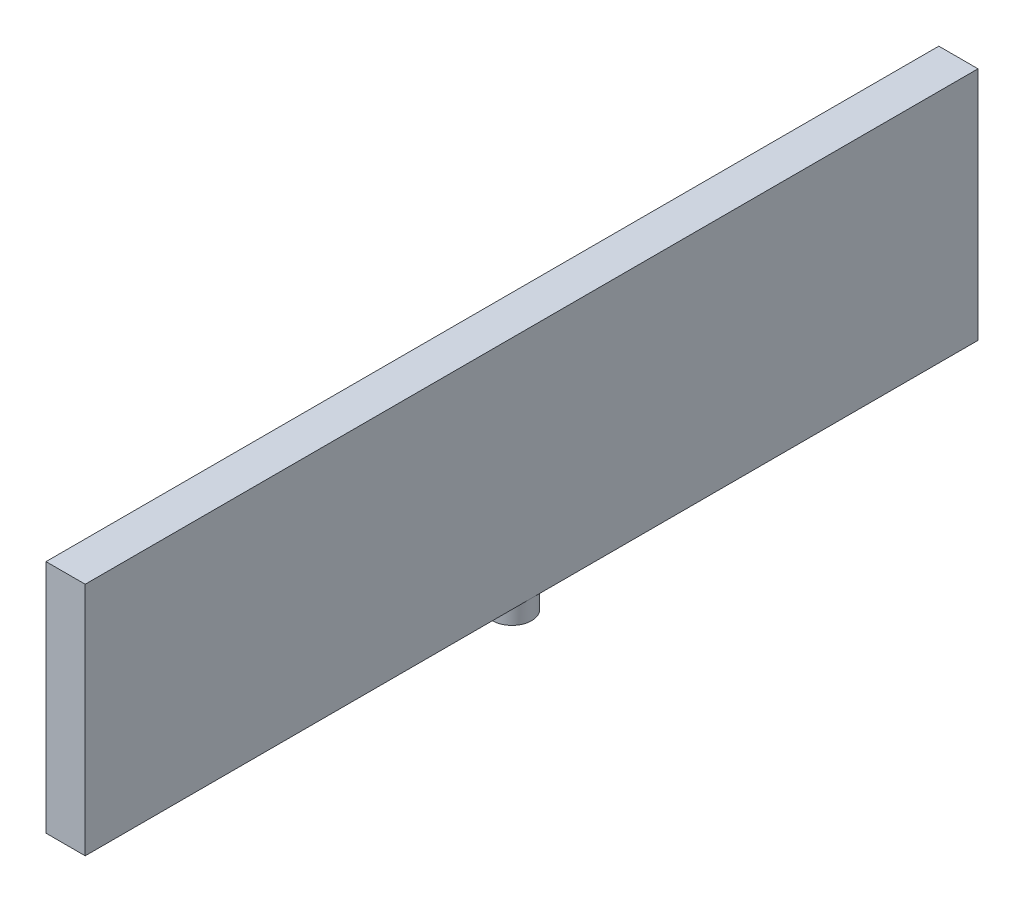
ISO-10303-21;
HEADER;
FILE_DESCRIPTION(('STEP AP214'),'2;1');
FILE_NAME('part.step','',(''),(''),'','','');
FILE_SCHEMA(('AUTOMOTIVE_DESIGN { 1 0 10303 214 1 1 1 1 }'));
ENDSEC;
DATA;
#1=APPLICATION_CONTEXT('core data for automotive mechanical design processes');
#2=APPLICATION_PROTOCOL_DEFINITION('international standard','automotive_design',2000,#1);
#3=PRODUCT_CONTEXT('',#1,'mechanical');
#4=PRODUCT('Part','Part','',(#3));
#5=PRODUCT_RELATED_PRODUCT_CATEGORY('part','',(#4));
#6=PRODUCT_DEFINITION_FORMATION('','',#4);
#7=PRODUCT_DEFINITION_CONTEXT('part definition',#1,'design');
#8=PRODUCT_DEFINITION('design','',#6,#7);
#9=PRODUCT_DEFINITION_SHAPE('','',#8);
#10=(LENGTH_UNIT() NAMED_UNIT(*) SI_UNIT(.MILLI.,.METRE.));
#11=(NAMED_UNIT(*) PLANE_ANGLE_UNIT() SI_UNIT($,.RADIAN.));
#12=(NAMED_UNIT(*) SI_UNIT($,.STERADIAN.) SOLID_ANGLE_UNIT());
#13=UNCERTAINTY_MEASURE_WITH_UNIT(LENGTH_MEASURE(1.E-05),#10,'distance_accuracy_value','');
#14=(GEOMETRIC_REPRESENTATION_CONTEXT(3) GLOBAL_UNCERTAINTY_ASSIGNED_CONTEXT((#13)) GLOBAL_UNIT_ASSIGNED_CONTEXT((#10,
#11,#12)) REPRESENTATION_CONTEXT('',''));
#15=CARTESIAN_POINT('',(0.,0.,0.));
#16=DIRECTION('',(0.,0.,1.));
#17=DIRECTION('',(1.,0.,0.));
#18=AXIS2_PLACEMENT_3D('',#15,#16,#17);
#19=CARTESIAN_POINT('',(260.155867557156,291.720306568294,-366.472666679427));
#20=DIRECTION('',(0.,-1.,0.));
#21=DIRECTION('',(0.,0.,-1.));
#22=AXIS2_PLACEMENT_3D('',#19,#20,#21);
#23=PLANE('',#22);
#24=CARTESIAN_POINT('',(266.505867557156,291.720306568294,-144.61079127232));
#25=DIRECTION('',(0.,-1.,0.));
#26=DIRECTION('',(0.,0.,-1.));
#27=AXIS2_PLACEMENT_3D('',#24,#25,#26);
#28=CIRCLE('',#27,6.35000000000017);
#29=CARTESIAN_POINT('',(272.855867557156,291.720306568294,-144.61079127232));
#30=VERTEX_POINT('',#29);
#31=CARTESIAN_POINT('',(260.155867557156,291.720306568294,-144.61079127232));
#32=VERTEX_POINT('',#31);
#33=EDGE_CURVE('E47',#30,#32,#28,.T.);
#34=ORIENTED_EDGE('',*,*,#33,.F.);
#35=DIRECTION('',(0.,0.,1.));
#36=VECTOR('',#35,1.);
#37=CARTESIAN_POINT('',(272.855867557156,291.720306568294,-366.472666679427));
#38=LINE('',#37,#36);
#39=CARTESIAN_POINT('',(272.855867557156,291.720306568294,0.));
#40=VERTEX_POINT('',#39);
#41=EDGE_CURVE('E96',#30,#40,#38,.T.);
#42=ORIENTED_EDGE('',*,*,#41,.T.);
#43=DIRECTION('',(1.,0.,0.));
#44=VECTOR('',#43,1.);
#45=CARTESIAN_POINT('',(260.155867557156,291.720306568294,0.));
#46=LINE('',#45,#44);
#47=CARTESIAN_POINT('',(260.155867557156,291.720306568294,0.));
#48=VERTEX_POINT('',#47);
#49=EDGE_CURVE('E161',#48,#40,#46,.T.);
#50=ORIENTED_EDGE('',*,*,#49,.F.);
#51=DIRECTION('',(0.,0.,1.));
#52=VECTOR('',#51,1.);
#53=CARTESIAN_POINT('',(260.155867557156,291.720306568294,-366.472666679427));
#54=LINE('',#53,#52);
#55=EDGE_CURVE('E108',#32,#48,#54,.T.);
#56=ORIENTED_EDGE('',*,*,#55,.F.);
#57=EDGE_LOOP('',(#34,#42,#50,#56));
#58=FACE_BOUND('',#57,.T.);
#59=ADVANCED_FACE('F37',(#58),#23,.T.);
#60=CARTESIAN_POINT('',(260.155867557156,291.720306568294,-366.472666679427));
#61=DIRECTION('',(-1.,0.,0.));
#62=DIRECTION('',(0.,0.,1.));
#63=AXIS2_PLACEMENT_3D('',#60,#61,#62);
#64=PLANE('',#63);
#65=DIRECTION('',(0.,1.,0.));
#66=VECTOR('',#65,1.);
#67=CARTESIAN_POINT('',(260.155867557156,291.720306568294,-289.22158254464));
#68=LINE('',#67,#66);
#69=CARTESIAN_POINT('',(260.155867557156,291.720306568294,-289.22158254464));
#70=VERTEX_POINT('',#69);
#71=CARTESIAN_POINT('',(260.155867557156,367.920306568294,-289.22158254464));
#72=VERTEX_POINT('',#71);
#73=EDGE_CURVE('E68',#70,#72,#68,.T.);
#74=ORIENTED_EDGE('',*,*,#73,.F.);
#75=EDGE_CURVE('E106',#70,#32,#54,.T.);
#76=ORIENTED_EDGE('',*,*,#75,.T.);
#77=ORIENTED_EDGE('',*,*,#55,.T.);
#78=DIRECTION('',(0.,-1.,0.));
#79=VECTOR('',#78,1.);
#80=CARTESIAN_POINT('',(260.155867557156,291.720306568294,0.));
#81=LINE('',#80,#79);
#82=CARTESIAN_POINT('',(260.155867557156,367.920306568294,0.));
#83=VERTEX_POINT('',#82);
#84=EDGE_CURVE('E151',#83,#48,#81,.T.);
#85=ORIENTED_EDGE('',*,*,#84,.F.);
#86=DIRECTION('',(0.,0.,1.));
#87=VECTOR('',#86,1.);
#88=CARTESIAN_POINT('',(260.155867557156,367.920306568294,-366.472666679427));
#89=LINE('',#88,#87);
#90=EDGE_CURVE('E79',#72,#83,#89,.T.);
#91=ORIENTED_EDGE('',*,*,#90,.F.);
#92=EDGE_LOOP('',(#74,#76,#77,#85,#91));
#93=FACE_BOUND('',#92,.T.);
#94=ADVANCED_FACE('F39',(#93),#64,.T.);
#95=CARTESIAN_POINT('',(260.155867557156,367.920306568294,-366.472666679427));
#96=DIRECTION('',(0.,1.,0.));
#97=DIRECTION('',(0.,0.,1.));
#98=AXIS2_PLACEMENT_3D('',#95,#96,#97);
#99=PLANE('',#98);
#100=DIRECTION('',(1.,0.,0.));
#101=VECTOR('',#100,1.);
#102=CARTESIAN_POINT('',(260.155867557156,367.920306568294,-289.22158254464));
#103=LINE('',#102,#101);
#104=CARTESIAN_POINT('',(272.855867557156,367.920306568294,-289.22158254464));
#105=VERTEX_POINT('',#104);
#106=EDGE_CURVE('E148',#72,#105,#103,.T.);
#107=ORIENTED_EDGE('',*,*,#106,.F.);
#108=ORIENTED_EDGE('',*,*,#90,.T.);
#109=DIRECTION('',(-1.,0.,0.));
#110=VECTOR('',#109,1.);
#111=CARTESIAN_POINT('',(260.155867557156,367.920306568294,0.));
#112=LINE('',#111,#110);
#113=CARTESIAN_POINT('',(272.855867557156,367.920306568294,0.));
#114=VERTEX_POINT('',#113);
#115=EDGE_CURVE('E158',#114,#83,#112,.T.);
#116=ORIENTED_EDGE('',*,*,#115,.F.);
#117=DIRECTION('',(0.,0.,1.));
#118=VECTOR('',#117,1.);
#119=CARTESIAN_POINT('',(272.855867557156,367.920306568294,-366.472666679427));
#120=LINE('',#119,#118);
#121=EDGE_CURVE('E95',#105,#114,#120,.T.);
#122=ORIENTED_EDGE('',*,*,#121,.F.);
#123=EDGE_LOOP('',(#107,#108,#116,#122));
#124=FACE_BOUND('',#123,.T.);
#125=ADVANCED_FACE('F131',(#124),#99,.T.);
#126=CARTESIAN_POINT('',(272.855867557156,291.720306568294,-366.472666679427));
#127=DIRECTION('',(1.,0.,0.));
#128=DIRECTION('',(0.,0.,-1.));
#129=AXIS2_PLACEMENT_3D('',#126,#127,#128);
#130=PLANE('',#129);
#131=DIRECTION('',(0.,-1.,0.));
#132=VECTOR('',#131,1.);
#133=CARTESIAN_POINT('',(272.855867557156,291.720306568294,-289.22158254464));
#134=LINE('',#133,#132);
#135=CARTESIAN_POINT('',(272.855867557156,291.720306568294,-289.22158254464));
#136=VERTEX_POINT('',#135);
#137=EDGE_CURVE('E72',#105,#136,#134,.T.);
#138=ORIENTED_EDGE('',*,*,#137,.F.);
#139=ORIENTED_EDGE('',*,*,#121,.T.);
#140=DIRECTION('',(0.,1.,0.));
#141=VECTOR('',#140,1.);
#142=CARTESIAN_POINT('',(272.855867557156,291.720306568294,0.));
#143=LINE('',#142,#141);
#144=EDGE_CURVE('E102',#40,#114,#143,.T.);
#145=ORIENTED_EDGE('',*,*,#144,.F.);
#146=ORIENTED_EDGE('',*,*,#41,.F.);
#147=EDGE_CURVE('E91',#136,#30,#38,.T.);
#148=ORIENTED_EDGE('',*,*,#147,.F.);
#149=EDGE_LOOP('',(#138,#139,#145,#146,#148));
#150=FACE_BOUND('',#149,.T.);
#151=ADVANCED_FACE('F100',(#150),#130,.T.);
#152=EDGE_CURVE('E11',#32,#30,#28,.T.);
#153=ORIENTED_EDGE('',*,*,#152,.F.);
#154=ORIENTED_EDGE('',*,*,#75,.F.);
#155=DIRECTION('',(-1.,0.,0.));
#156=VECTOR('',#155,1.);
#157=CARTESIAN_POINT('',(260.155867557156,291.720306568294,-289.22158254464));
#158=LINE('',#157,#156);
#159=EDGE_CURVE('E41',#136,#70,#158,.T.);
#160=ORIENTED_EDGE('',*,*,#159,.F.);
#161=ORIENTED_EDGE('',*,*,#147,.T.);
#162=EDGE_LOOP('',(#153,#154,#160,#161));
#163=FACE_BOUND('',#162,.T.);
#164=ADVANCED_FACE('F93',(#163),#23,.T.);
#165=CARTESIAN_POINT('',(260.155867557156,367.920306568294,0.));
#166=DIRECTION('',(0.,0.,-1.));
#167=DIRECTION('',(-1.,0.,0.));
#168=AXIS2_PLACEMENT_3D('',#165,#166,#167);
#169=PLANE('',#168);
#170=ORIENTED_EDGE('',*,*,#84,.T.);
#171=ORIENTED_EDGE('',*,*,#49,.T.);
#172=ORIENTED_EDGE('',*,*,#144,.T.);
#173=ORIENTED_EDGE('',*,*,#115,.T.);
#174=EDGE_LOOP('',(#170,#171,#172,#173));
#175=FACE_BOUND('',#174,.T.);
#176=ADVANCED_FACE('F124',(#175),#169,.F.);
#177=CARTESIAN_POINT('',(260.155867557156,367.920306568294,-289.22158254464));
#178=DIRECTION('',(0.,0.,1.));
#179=DIRECTION('',(1.,0.,0.));
#180=AXIS2_PLACEMENT_3D('',#177,#178,#179);
#181=PLANE('',#180);
#182=ORIENTED_EDGE('',*,*,#73,.T.);
#183=ORIENTED_EDGE('',*,*,#106,.T.);
#184=ORIENTED_EDGE('',*,*,#137,.T.);
#185=ORIENTED_EDGE('',*,*,#159,.T.);
#186=EDGE_LOOP('',(#182,#183,#184,#185));
#187=FACE_BOUND('',#186,.T.);
#188=ADVANCED_FACE('F115',(#187),#181,.F.);
#189=CARTESIAN_POINT('',(266.505867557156,285.370306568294,-144.61079127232));
#190=DIRECTION('',(0.,1.,0.));
#191=DIRECTION('',(0.,0.,1.));
#192=AXIS2_PLACEMENT_3D('',#189,#190,#191);
#193=CYLINDRICAL_SURFACE('',#192,6.35000000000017);
#194=CARTESIAN_POINT('',(266.505867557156,285.370306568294,-144.61079127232));
#195=DIRECTION('',(0.,-1.,0.));
#196=DIRECTION('',(0.,0.,-1.));
#197=AXIS2_PLACEMENT_3D('',#194,#195,#196);
#198=CIRCLE('',#197,6.35000000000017);
#199=CARTESIAN_POINT('',(266.505867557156,285.370306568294,-150.96079127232));
#200=VERTEX_POINT('',#199);
#201=EDGE_CURVE('E111',#200,#200,#198,.T.);
#202=ORIENTED_EDGE('',*,*,#201,.F.);
#203=EDGE_LOOP('',(#202));
#204=FACE_BOUND('',#203,.T.);
#205=ORIENTED_EDGE('',*,*,#33,.T.);
#206=ORIENTED_EDGE('',*,*,#152,.T.);
#207=EDGE_LOOP('',(#205,#206));
#208=FACE_BOUND('',#207,.T.);
#209=ADVANCED_FACE('F112',(#204,#208),#193,.T.);
#210=CARTESIAN_POINT('',(266.505867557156,285.370306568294,-144.61079127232));
#211=DIRECTION('',(0.,-1.,0.));
#212=DIRECTION('',(0.,0.,-1.));
#213=AXIS2_PLACEMENT_3D('',#210,#211,#212);
#214=PLANE('',#213);
#215=ORIENTED_EDGE('',*,*,#201,.T.);
#216=EDGE_LOOP('',(#215));
#217=FACE_BOUND('',#216,.T.);
#218=ADVANCED_FACE('F114',(#217),#214,.T.);
#219=CLOSED_SHELL('',(#59,#94,#125,#151,#164,#176,#188,#209,#218));
#220=MANIFOLD_SOLID_BREP('B2',#219);
#221=ADVANCED_BREP_SHAPE_REPRESENTATION('',(#18,#220),#14);
#222=SHAPE_DEFINITION_REPRESENTATION(#9,#221);
ENDSEC;
END-ISO-10303-21;
